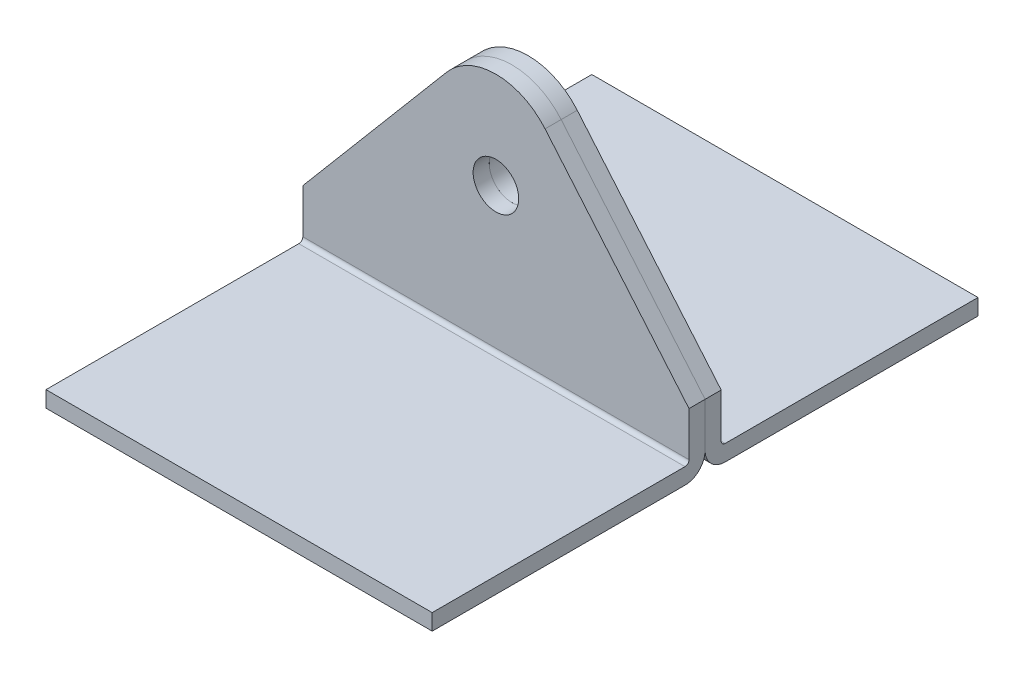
ISO-10303-21;
HEADER;
FILE_DESCRIPTION(('STEP AP214'),'2;1');
FILE_NAME('part.step','',(''),(''),'','','');
FILE_SCHEMA(('AUTOMOTIVE_DESIGN { 1 0 10303 214 1 1 1 1 }'));
ENDSEC;
DATA;
#1=APPLICATION_CONTEXT('core data for automotive mechanical design processes');
#2=APPLICATION_PROTOCOL_DEFINITION('international standard','automotive_design',2000,#1);
#3=PRODUCT_CONTEXT('',#1,'mechanical');
#4=PRODUCT('Part','Part','',(#3));
#5=PRODUCT_RELATED_PRODUCT_CATEGORY('part','',(#4));
#6=PRODUCT_DEFINITION_FORMATION('','',#4);
#7=PRODUCT_DEFINITION_CONTEXT('part definition',#1,'design');
#8=PRODUCT_DEFINITION('design','',#6,#7);
#9=PRODUCT_DEFINITION_SHAPE('','',#8);
#10=(LENGTH_UNIT() NAMED_UNIT(*) SI_UNIT(.MILLI.,.METRE.));
#11=(NAMED_UNIT(*) PLANE_ANGLE_UNIT() SI_UNIT($,.RADIAN.));
#12=(NAMED_UNIT(*) SI_UNIT($,.STERADIAN.) SOLID_ANGLE_UNIT());
#13=UNCERTAINTY_MEASURE_WITH_UNIT(LENGTH_MEASURE(1.E-05),#10,'distance_accuracy_value','');
#14=(GEOMETRIC_REPRESENTATION_CONTEXT(3) GLOBAL_UNCERTAINTY_ASSIGNED_CONTEXT((#13)) GLOBAL_UNIT_ASSIGNED_CONTEXT((#10,
#11,#12)) REPRESENTATION_CONTEXT('',''));
#15=CARTESIAN_POINT('',(0.,0.,0.));
#16=DIRECTION('',(0.,0.,1.));
#17=DIRECTION('',(1.,0.,0.));
#18=AXIS2_PLACEMENT_3D('',#15,#16,#17);
#19=CARTESIAN_POINT('',(-19.05,1.984375,0.));
#20=DIRECTION('',(0.,0.,-1.));
#21=DIRECTION('',(-1.,0.,0.));
#22=AXIS2_PLACEMENT_3D('',#19,#20,#21);
#23=PLANE('',#22);
#24=CARTESIAN_POINT('',(0.,15.875,0.));
#25=DIRECTION('',(0.,0.,1.));
#26=DIRECTION('',(1.,0.,0.));
#27=AXIS2_PLACEMENT_3D('',#24,#25,#26);
#28=CIRCLE('',#27,2.24789999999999);
#29=CARTESIAN_POINT('',(2.24789999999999,15.875,0.));
#30=VERTEX_POINT('',#29);
#31=EDGE_CURVE('P0_E196',#30,#30,#28,.T.);
#32=ORIENTED_EDGE('',*,*,#31,.F.);
#33=EDGE_LOOP('',(#32));
#34=FACE_BOUND('',#33,.T.);
#35=DIRECTION('',(0.,1.,0.));
#36=VECTOR('',#35,1.);
#37=CARTESIAN_POINT('',(19.05,1.984375,0.));
#38=LINE('',#37,#36);
#39=CARTESIAN_POINT('',(19.05,1.984375,0.));
#40=VERTEX_POINT('',#39);
#41=CARTESIAN_POINT('',(19.05,6.34999999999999,0.));
#42=VERTEX_POINT('',#41);
#43=EDGE_CURVE('P0_E117',#40,#42,#38,.T.);
#44=ORIENTED_EDGE('',*,*,#43,.T.);
#45=DIRECTION('',(-0.645561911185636,0.763707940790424,0.));
#46=VECTOR('',#45,1.);
#47=CARTESIAN_POINT('',(5.32416184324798,22.5878408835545,0.));
#48=LINE('',#47,#46);
#49=CARTESIAN_POINT('',(4.84954542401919,23.1493181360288,0.));
#50=VERTEX_POINT('',#49);
#51=EDGE_CURVE('P0_E31',#42,#50,#48,.T.);
#52=ORIENTED_EDGE('',*,*,#51,.T.);
#53=CARTESIAN_POINT('',(0.,19.05,0.));
#54=DIRECTION('',(0.,0.,-1.));
#55=DIRECTION('',(-1.,0.,0.));
#56=AXIS2_PLACEMENT_3D('',#53,#54,#55);
#57=CIRCLE('',#56,6.35);
#58=CARTESIAN_POINT('',(-4.84954542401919,23.1493181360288,0.));
#59=VERTEX_POINT('',#58);
#60=EDGE_CURVE('P0_E121',#50,#59,#57,.F.);
#61=ORIENTED_EDGE('',*,*,#60,.T.);
#62=DIRECTION('',(-0.645561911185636,-0.763707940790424,0.));
#63=VECTOR('',#62,1.);
#64=CARTESIAN_POINT('',(-21.2023437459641,3.80375000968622,0.));
#65=LINE('',#64,#63);
#66=CARTESIAN_POINT('',(-19.05,6.35,0.));
#67=VERTEX_POINT('',#66);
#68=EDGE_CURVE('P0_E152',#59,#67,#65,.T.);
#69=ORIENTED_EDGE('',*,*,#68,.T.);
#70=DIRECTION('',(0.,1.,0.));
#71=VECTOR('',#70,1.);
#72=CARTESIAN_POINT('',(-19.05,1.984375,0.));
#73=LINE('',#72,#71);
#74=CARTESIAN_POINT('',(-19.05,1.984375,0.));
#75=VERTEX_POINT('',#74);
#76=EDGE_CURVE('P0_E134',#75,#67,#73,.T.);
#77=ORIENTED_EDGE('',*,*,#76,.F.);
#78=DIRECTION('',(1.,0.,0.));
#79=VECTOR('',#78,1.);
#80=CARTESIAN_POINT('',(-19.05,1.984375,0.));
#81=LINE('',#80,#79);
#82=EDGE_CURVE('P0_E116',#75,#40,#81,.T.);
#83=ORIENTED_EDGE('',*,*,#82,.T.);
#84=EDGE_LOOP('',(#44,#52,#61,#69,#77,#83));
#85=FACE_BOUND('',#84,.T.);
#86=ADVANCED_FACE('P0_F16',(#34,#85),#23,.F.);
#87=CARTESIAN_POINT('',(-19.05,1.984375,-1.5875));
#88=DIRECTION('',(0.,0.,-1.));
#89=DIRECTION('',(-1.,0.,0.));
#90=AXIS2_PLACEMENT_3D('',#87,#88,#89);
#91=PLANE('',#90);
#92=CARTESIAN_POINT('',(0.,15.875,-1.5875));
#93=DIRECTION('',(0.,0.,-1.));
#94=DIRECTION('',(-1.,0.,0.));
#95=AXIS2_PLACEMENT_3D('',#92,#93,#94);
#96=CIRCLE('',#95,2.24789999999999);
#97=CARTESIAN_POINT('',(2.24789999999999,15.875,-1.5875));
#98=VERTEX_POINT('',#97);
#99=EDGE_CURVE('P0_E19',#98,#98,#96,.T.);
#100=ORIENTED_EDGE('',*,*,#99,.F.);
#101=EDGE_LOOP('',(#100));
#102=FACE_BOUND('',#101,.T.);
#103=DIRECTION('',(-0.645561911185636,0.763707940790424,0.));
#104=VECTOR('',#103,1.);
#105=CARTESIAN_POINT('',(5.32416184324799,22.5878408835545,-1.5875));
#106=LINE('',#105,#104);
#107=CARTESIAN_POINT('',(19.05,6.35,-1.5875));
#108=VERTEX_POINT('',#107);
#109=CARTESIAN_POINT('',(4.84954542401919,23.1493181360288,-1.5875));
#110=VERTEX_POINT('',#109);
#111=EDGE_CURVE('P0_E183',#108,#110,#106,.T.);
#112=ORIENTED_EDGE('',*,*,#111,.F.);
#113=DIRECTION('',(0.,1.,0.));
#114=VECTOR('',#113,1.);
#115=CARTESIAN_POINT('',(19.05,1.984375,-1.5875));
#116=LINE('',#115,#114);
#117=CARTESIAN_POINT('',(19.05,1.984375,-1.5875));
#118=VERTEX_POINT('',#117);
#119=EDGE_CURVE('P0_E120',#118,#108,#116,.T.);
#120=ORIENTED_EDGE('',*,*,#119,.F.);
#121=DIRECTION('',(1.,0.,0.));
#122=VECTOR('',#121,1.);
#123=CARTESIAN_POINT('',(-19.05,1.984375,-1.5875));
#124=LINE('',#123,#122);
#125=CARTESIAN_POINT('',(-19.05,1.984375,-1.5875));
#126=VERTEX_POINT('',#125);
#127=EDGE_CURVE('P0_E75',#126,#118,#124,.T.);
#128=ORIENTED_EDGE('',*,*,#127,.F.);
#129=DIRECTION('',(0.,1.,0.));
#130=VECTOR('',#129,1.);
#131=CARTESIAN_POINT('',(-19.05,1.984375,-1.5875));
#132=LINE('',#131,#130);
#133=CARTESIAN_POINT('',(-19.05,6.35,-1.5875));
#134=VERTEX_POINT('',#133);
#135=EDGE_CURVE('P0_E164',#126,#134,#132,.T.);
#136=ORIENTED_EDGE('',*,*,#135,.T.);
#137=DIRECTION('',(-0.645561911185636,-0.763707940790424,0.));
#138=VECTOR('',#137,1.);
#139=CARTESIAN_POINT('',(-21.2023437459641,3.80375000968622,-1.5875));
#140=LINE('',#139,#138);
#141=CARTESIAN_POINT('',(-4.84954542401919,23.1493181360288,-1.5875));
#142=VERTEX_POINT('',#141);
#143=EDGE_CURVE('P0_E156',#142,#134,#140,.T.);
#144=ORIENTED_EDGE('',*,*,#143,.F.);
#145=CARTESIAN_POINT('',(0.,19.05,-1.5875));
#146=DIRECTION('',(0.,0.,-1.));
#147=DIRECTION('',(-1.,0.,0.));
#148=AXIS2_PLACEMENT_3D('',#145,#146,#147);
#149=CIRCLE('',#148,6.35);
#150=EDGE_CURVE('P0_E11',#110,#142,#149,.F.);
#151=ORIENTED_EDGE('',*,*,#150,.F.);
#152=EDGE_LOOP('',(#112,#120,#128,#136,#144,#151));
#153=FACE_BOUND('',#152,.T.);
#154=ADVANCED_FACE('P0_F187',(#102,#153),#91,.T.);
#155=CARTESIAN_POINT('',(-19.05,1.984375,-1.984375));
#156=DIRECTION('',(1.,0.,0.));
#157=DIRECTION('',(0.,0.,-1.));
#158=AXIS2_PLACEMENT_3D('',#155,#156,#157);
#159=CYLINDRICAL_SURFACE('',#158,0.396875);
#160=CARTESIAN_POINT('',(19.05,1.984375,-1.984375));
#161=DIRECTION('',(-1.,0.,0.));
#162=DIRECTION('',(0.,0.,1.));
#163=AXIS2_PLACEMENT_3D('',#160,#161,#162);
#164=CIRCLE('',#163,0.396875);
#165=CARTESIAN_POINT('',(19.05,1.5875,-1.984375));
#166=VERTEX_POINT('',#165);
#167=EDGE_CURVE('P0_E124',#166,#118,#164,.T.);
#168=ORIENTED_EDGE('',*,*,#167,.F.);
#169=DIRECTION('',(1.,0.,0.));
#170=VECTOR('',#169,1.);
#171=CARTESIAN_POINT('',(-19.05,1.5875,-1.984375));
#172=LINE('',#171,#170);
#173=CARTESIAN_POINT('',(-19.05,1.5875,-1.984375));
#174=VERTEX_POINT('',#173);
#175=EDGE_CURVE('P0_E138',#174,#166,#172,.T.);
#176=ORIENTED_EDGE('',*,*,#175,.F.);
#177=CARTESIAN_POINT('',(-19.05,1.984375,-1.984375));
#178=DIRECTION('',(-1.,0.,0.));
#179=DIRECTION('',(0.,0.,1.));
#180=AXIS2_PLACEMENT_3D('',#177,#178,#179);
#181=CIRCLE('',#180,0.396875);
#182=EDGE_CURVE('P0_E111',#174,#126,#181,.T.);
#183=ORIENTED_EDGE('',*,*,#182,.T.);
#184=ORIENTED_EDGE('',*,*,#127,.T.);
#185=EDGE_LOOP('',(#168,#176,#183,#184));
#186=FACE_BOUND('',#185,.T.);
#187=ADVANCED_FACE('P0_F171',(#186),#159,.F.);
#188=CARTESIAN_POINT('',(-19.05,1.5875,-1.984375));
#189=DIRECTION('',(0.,1.,0.));
#190=DIRECTION('',(0.,0.,-1.));
#191=AXIS2_PLACEMENT_3D('',#188,#189,#190);
#192=PLANE('',#191);
#193=DIRECTION('',(0.,0.,1.));
#194=VECTOR('',#193,1.);
#195=CARTESIAN_POINT('',(19.05,1.5875,-1.984375));
#196=LINE('',#195,#194);
#197=CARTESIAN_POINT('',(19.05,1.5875,-26.924));
#198=VERTEX_POINT('',#197);
#199=EDGE_CURVE('P0_E127',#198,#166,#196,.T.);
#200=ORIENTED_EDGE('',*,*,#199,.F.);
#201=DIRECTION('',(1.,0.,0.));
#202=VECTOR('',#201,1.);
#203=CARTESIAN_POINT('',(-19.05,1.5875,-26.924));
#204=LINE('',#203,#202);
#205=CARTESIAN_POINT('',(-19.05,1.5875,-26.924));
#206=VERTEX_POINT('',#205);
#207=EDGE_CURVE('P0_E97',#206,#198,#204,.T.);
#208=ORIENTED_EDGE('',*,*,#207,.F.);
#209=DIRECTION('',(0.,0.,1.));
#210=VECTOR('',#209,1.);
#211=CARTESIAN_POINT('',(-19.05,1.5875,-1.984375));
#212=LINE('',#211,#210);
#213=EDGE_CURVE('P0_E109',#206,#174,#212,.T.);
#214=ORIENTED_EDGE('',*,*,#213,.T.);
#215=ORIENTED_EDGE('',*,*,#175,.T.);
#216=EDGE_LOOP('',(#200,#208,#214,#215));
#217=FACE_BOUND('',#216,.T.);
#218=ADVANCED_FACE('P0_F174',(#217),#192,.T.);
#219=CARTESIAN_POINT('',(-19.05,0.,-26.924));
#220=DIRECTION('',(0.,0.,-1.));
#221=DIRECTION('',(-1.,0.,0.));
#222=AXIS2_PLACEMENT_3D('',#219,#220,#221);
#223=PLANE('',#222);
#224=DIRECTION('',(0.,1.,0.));
#225=VECTOR('',#224,1.);
#226=CARTESIAN_POINT('',(19.05,0.,-26.924));
#227=LINE('',#226,#225);
#228=CARTESIAN_POINT('',(19.05,0.,-26.924));
#229=VERTEX_POINT('',#228);
#230=EDGE_CURVE('P0_E94',#229,#198,#227,.T.);
#231=ORIENTED_EDGE('',*,*,#230,.F.);
#232=DIRECTION('',(1.,0.,0.));
#233=VECTOR('',#232,1.);
#234=CARTESIAN_POINT('',(-19.05,0.,-26.924));
#235=LINE('',#234,#233);
#236=CARTESIAN_POINT('',(-19.05,0.,-26.924));
#237=VERTEX_POINT('',#236);
#238=EDGE_CURVE('P0_E88',#237,#229,#235,.T.);
#239=ORIENTED_EDGE('',*,*,#238,.F.);
#240=DIRECTION('',(0.,1.,0.));
#241=VECTOR('',#240,1.);
#242=CARTESIAN_POINT('',(-19.05,0.,-26.924));
#243=LINE('',#242,#241);
#244=EDGE_CURVE('P0_E92',#237,#206,#243,.T.);
#245=ORIENTED_EDGE('',*,*,#244,.T.);
#246=ORIENTED_EDGE('',*,*,#207,.T.);
#247=EDGE_LOOP('',(#231,#239,#245,#246));
#248=FACE_BOUND('',#247,.T.);
#249=ADVANCED_FACE('P0_F90',(#248),#223,.T.);
#250=CARTESIAN_POINT('',(-19.05,0.,-1.984375));
#251=DIRECTION('',(0.,1.,0.));
#252=DIRECTION('',(0.,0.,-1.));
#253=AXIS2_PLACEMENT_3D('',#250,#251,#252);
#254=PLANE('',#253);
#255=DIRECTION('',(0.,0.,1.));
#256=VECTOR('',#255,1.);
#257=CARTESIAN_POINT('',(19.05,0.,-1.984375));
#258=LINE('',#257,#256);
#259=CARTESIAN_POINT('',(19.05,0.,-1.984375));
#260=VERTEX_POINT('',#259);
#261=EDGE_CURVE('P0_E131',#229,#260,#258,.T.);
#262=ORIENTED_EDGE('',*,*,#261,.T.);
#263=DIRECTION('',(1.,0.,0.));
#264=VECTOR('',#263,1.);
#265=CARTESIAN_POINT('',(-19.05,0.,-1.984375));
#266=LINE('',#265,#264);
#267=CARTESIAN_POINT('',(-19.05,0.,-1.984375));
#268=VERTEX_POINT('',#267);
#269=EDGE_CURVE('P0_E98',#268,#260,#266,.T.);
#270=ORIENTED_EDGE('',*,*,#269,.F.);
#271=DIRECTION('',(0.,0.,1.));
#272=VECTOR('',#271,1.);
#273=CARTESIAN_POINT('',(-19.05,0.,-1.984375));
#274=LINE('',#273,#272);
#275=EDGE_CURVE('P0_E101',#237,#268,#274,.T.);
#276=ORIENTED_EDGE('',*,*,#275,.F.);
#277=ORIENTED_EDGE('',*,*,#238,.T.);
#278=EDGE_LOOP('',(#262,#270,#276,#277));
#279=FACE_BOUND('',#278,.T.);
#280=ADVANCED_FACE('P0_F102',(#279),#254,.F.);
#281=CARTESIAN_POINT('',(-19.05,1.984375,-1.984375));
#282=DIRECTION('',(1.,0.,0.));
#283=DIRECTION('',(0.,0.,-1.));
#284=AXIS2_PLACEMENT_3D('',#281,#282,#283);
#285=CYLINDRICAL_SURFACE('',#284,1.984375);
#286=CARTESIAN_POINT('',(19.05,1.984375,-1.984375));
#287=DIRECTION('',(-1.,0.,0.));
#288=DIRECTION('',(0.,0.,1.));
#289=AXIS2_PLACEMENT_3D('',#286,#287,#288);
#290=CIRCLE('',#289,1.984375);
#291=EDGE_CURVE('P0_E67',#260,#40,#290,.T.);
#292=ORIENTED_EDGE('',*,*,#291,.T.);
#293=ORIENTED_EDGE('',*,*,#82,.F.);
#294=CARTESIAN_POINT('',(-19.05,1.984375,-1.984375));
#295=DIRECTION('',(-1.,0.,0.));
#296=DIRECTION('',(0.,0.,1.));
#297=AXIS2_PLACEMENT_3D('',#294,#295,#296);
#298=CIRCLE('',#297,1.984375);
#299=EDGE_CURVE('P0_E40',#268,#75,#298,.T.);
#300=ORIENTED_EDGE('',*,*,#299,.F.);
#301=ORIENTED_EDGE('',*,*,#269,.T.);
#302=EDGE_LOOP('',(#292,#293,#300,#301));
#303=FACE_BOUND('',#302,.T.);
#304=ADVANCED_FACE('P0_F178',(#303),#285,.T.);
#305=CARTESIAN_POINT('',(-19.05,1.984375,-1.984375));
#306=DIRECTION('',(-1.,0.,0.));
#307=DIRECTION('',(0.,0.,1.));
#308=AXIS2_PLACEMENT_3D('',#305,#306,#307);
#309=PLANE('',#308);
#310=DIRECTION('',(0.,0.,1.));
#311=VECTOR('',#310,1.);
#312=CARTESIAN_POINT('',(-19.05,6.35,-1.984375));
#313=LINE('',#312,#311);
#314=EDGE_CURVE('P0_E24',#134,#67,#313,.T.);
#315=ORIENTED_EDGE('',*,*,#314,.F.);
#316=ORIENTED_EDGE('',*,*,#135,.F.);
#317=ORIENTED_EDGE('',*,*,#182,.F.);
#318=ORIENTED_EDGE('',*,*,#213,.F.);
#319=ORIENTED_EDGE('',*,*,#244,.F.);
#320=ORIENTED_EDGE('',*,*,#275,.T.);
#321=ORIENTED_EDGE('',*,*,#299,.T.);
#322=ORIENTED_EDGE('',*,*,#76,.T.);
#323=EDGE_LOOP('',(#315,#316,#317,#318,#319,#320,#321,#322));
#324=FACE_BOUND('',#323,.T.);
#325=ADVANCED_FACE('P0_F106',(#324),#309,.T.);
#326=CARTESIAN_POINT('',(19.05,1.984375,-1.984375));
#327=DIRECTION('',(-1.,0.,0.));
#328=DIRECTION('',(0.,0.,1.));
#329=AXIS2_PLACEMENT_3D('',#326,#327,#328);
#330=PLANE('',#329);
#331=ORIENTED_EDGE('',*,*,#119,.T.);
#332=DIRECTION('',(0.,0.,1.));
#333=VECTOR('',#332,1.);
#334=CARTESIAN_POINT('',(19.05,6.35,-1.984375));
#335=LINE('',#334,#333);
#336=EDGE_CURVE('P0_E141',#108,#42,#335,.T.);
#337=ORIENTED_EDGE('',*,*,#336,.T.);
#338=ORIENTED_EDGE('',*,*,#43,.F.);
#339=ORIENTED_EDGE('',*,*,#291,.F.);
#340=ORIENTED_EDGE('',*,*,#261,.F.);
#341=ORIENTED_EDGE('',*,*,#230,.T.);
#342=ORIENTED_EDGE('',*,*,#199,.T.);
#343=ORIENTED_EDGE('',*,*,#167,.T.);
#344=EDGE_LOOP('',(#331,#337,#338,#339,#340,#341,#342,#343));
#345=FACE_BOUND('',#344,.T.);
#346=ADVANCED_FACE('P0_F176',(#345),#330,.F.);
#347=CARTESIAN_POINT('',(0.,19.05,66.3992631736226));
#348=DIRECTION('',(0.,0.,-1.));
#349=DIRECTION('',(-1.,0.,0.));
#350=AXIS2_PLACEMENT_3D('',#347,#348,#349);
#351=CYLINDRICAL_SURFACE('',#350,6.35);
#352=ORIENTED_EDGE('',*,*,#60,.F.);
#353=DIRECTION('',(0.,0.,-1.));
#354=VECTOR('',#353,1.);
#355=CARTESIAN_POINT('',(4.84954542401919,23.1493181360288,66.3992631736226));
#356=LINE('',#355,#354);
#357=EDGE_CURVE('P0_E188',#50,#110,#356,.T.);
#358=ORIENTED_EDGE('',*,*,#357,.T.);
#359=ORIENTED_EDGE('',*,*,#150,.T.);
#360=DIRECTION('',(0.,0.,-1.));
#361=VECTOR('',#360,1.);
#362=CARTESIAN_POINT('',(-4.84954542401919,23.1493181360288,66.3992631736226));
#363=LINE('',#362,#361);
#364=EDGE_CURVE('P0_E191',#59,#142,#363,.T.);
#365=ORIENTED_EDGE('',*,*,#364,.F.);
#366=EDGE_LOOP('',(#352,#358,#359,#365));
#367=FACE_BOUND('',#366,.T.);
#368=ADVANCED_FACE('P0_F224',(#367),#351,.T.);
#369=CARTESIAN_POINT('',(-4.8495454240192,23.1493181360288,66.3992631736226));
#370=DIRECTION('',(0.763707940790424,-0.645561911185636,0.));
#371=DIRECTION('',(-0.645561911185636,-0.763707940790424,0.));
#372=AXIS2_PLACEMENT_3D('',#369,#370,#371);
#373=PLANE('',#372);
#374=ORIENTED_EDGE('',*,*,#68,.F.);
#375=ORIENTED_EDGE('',*,*,#364,.T.);
#376=ORIENTED_EDGE('',*,*,#143,.T.);
#377=ORIENTED_EDGE('',*,*,#314,.T.);
#378=EDGE_LOOP('',(#374,#375,#376,#377));
#379=FACE_BOUND('',#378,.T.);
#380=ADVANCED_FACE('P0_F149',(#379),#373,.F.);
#381=CARTESIAN_POINT('',(19.05,6.34999999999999,66.3992631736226));
#382=DIRECTION('',(-0.763707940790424,-0.645561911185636,0.));
#383=DIRECTION('',(-0.645561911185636,0.763707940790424,0.));
#384=AXIS2_PLACEMENT_3D('',#381,#382,#383);
#385=PLANE('',#384);
#386=ORIENTED_EDGE('',*,*,#51,.F.);
#387=ORIENTED_EDGE('',*,*,#336,.F.);
#388=ORIENTED_EDGE('',*,*,#111,.T.);
#389=ORIENTED_EDGE('',*,*,#357,.F.);
#390=EDGE_LOOP('',(#386,#387,#388,#389));
#391=FACE_BOUND('',#390,.T.);
#392=ADVANCED_FACE('P0_F181',(#391),#385,.F.);
#393=CARTESIAN_POINT('',(0.,15.875,0.));
#394=DIRECTION('',(0.,0.,1.));
#395=DIRECTION('',(1.,0.,0.));
#396=AXIS2_PLACEMENT_3D('',#393,#394,#395);
#397=CYLINDRICAL_SURFACE('',#396,2.24789999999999);
#398=CARTESIAN_POINT('',(2.24789999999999,15.875,-1.5875));
#399=CARTESIAN_POINT('',(2.24789999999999,15.875,-1.57096354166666));
#400=CARTESIAN_POINT('',(2.24789999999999,15.875,-1.55442708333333));
#401=CARTESIAN_POINT('',(2.24789999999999,15.875,-1.52135416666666));
#402=CARTESIAN_POINT('',(2.24789999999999,15.875,-1.50481770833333));
#403=CARTESIAN_POINT('',(2.24789999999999,15.875,-1.47174479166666));
#404=CARTESIAN_POINT('',(2.24789999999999,15.875,-1.45520833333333));
#405=CARTESIAN_POINT('',(2.24789999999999,15.875,-1.42213541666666));
#406=CARTESIAN_POINT('',(2.24789999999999,15.875,-1.40559895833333));
#407=CARTESIAN_POINT('',(2.24789999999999,15.875,-1.37252604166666));
#408=CARTESIAN_POINT('',(2.24789999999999,15.875,-1.35598958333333));
#409=CARTESIAN_POINT('',(2.24789999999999,15.875,-1.32291666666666));
#410=CARTESIAN_POINT('',(2.24789999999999,15.875,-1.30638020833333));
#411=CARTESIAN_POINT('',(2.24789999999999,15.875,-1.27330729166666));
#412=CARTESIAN_POINT('',(2.24789999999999,15.875,-1.25677083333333));
#413=CARTESIAN_POINT('',(2.24789999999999,15.875,-1.22369791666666));
#414=CARTESIAN_POINT('',(2.24789999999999,15.875,-1.20716145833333));
#415=CARTESIAN_POINT('',(2.24789999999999,15.875,-1.17408854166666));
#416=CARTESIAN_POINT('',(2.24789999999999,15.875,-1.15755208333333));
#417=CARTESIAN_POINT('',(2.24789999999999,15.875,-1.12447916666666));
#418=CARTESIAN_POINT('',(2.24789999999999,15.875,-1.10794270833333));
#419=CARTESIAN_POINT('',(2.24789999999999,15.875,-1.07486979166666));
#420=CARTESIAN_POINT('',(2.24789999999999,15.875,-1.05833333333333));
#421=CARTESIAN_POINT('',(2.24789999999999,15.875,-1.02526041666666));
#422=CARTESIAN_POINT('',(2.24789999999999,15.875,-1.00872395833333));
#423=CARTESIAN_POINT('',(2.24789999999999,15.875,-0.975651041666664));
#424=CARTESIAN_POINT('',(2.24789999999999,15.875,-0.959114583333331));
#425=CARTESIAN_POINT('',(2.24789999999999,15.875,-0.926041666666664));
#426=CARTESIAN_POINT('',(2.24789999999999,15.875,-0.909505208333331));
#427=CARTESIAN_POINT('',(2.24789999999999,15.875,-0.876432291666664));
#428=CARTESIAN_POINT('',(2.24789999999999,15.875,-0.859895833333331));
#429=CARTESIAN_POINT('',(2.24789999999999,15.875,-0.826822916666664));
#430=CARTESIAN_POINT('',(2.24789999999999,15.875,-0.810286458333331));
#431=CARTESIAN_POINT('',(2.24789999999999,15.875,-0.777213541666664));
#432=CARTESIAN_POINT('',(2.24789999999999,15.875,-0.760677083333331));
#433=CARTESIAN_POINT('',(2.24789999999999,15.875,-0.727604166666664));
#434=CARTESIAN_POINT('',(2.24789999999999,15.875,-0.711067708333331));
#435=CARTESIAN_POINT('',(2.24789999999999,15.875,-0.677994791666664));
#436=CARTESIAN_POINT('',(2.24789999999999,15.875,-0.661458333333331));
#437=CARTESIAN_POINT('',(2.24789999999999,15.875,-0.628385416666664));
#438=CARTESIAN_POINT('',(2.24789999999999,15.875,-0.611848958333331));
#439=CARTESIAN_POINT('',(2.24789999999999,15.875,-0.578776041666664));
#440=CARTESIAN_POINT('',(2.24789999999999,15.875,-0.56223958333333));
#441=CARTESIAN_POINT('',(2.24789999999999,15.875,-0.529166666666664));
#442=CARTESIAN_POINT('',(2.24789999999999,15.875,-0.51263020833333));
#443=CARTESIAN_POINT('',(2.24789999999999,15.875,-0.479557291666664));
#444=CARTESIAN_POINT('',(2.24789999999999,15.875,-0.46302083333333));
#445=CARTESIAN_POINT('',(2.24789999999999,15.875,-0.429947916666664));
#446=CARTESIAN_POINT('',(2.24789999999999,15.875,-0.41341145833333));
#447=CARTESIAN_POINT('',(2.24789999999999,15.875,-0.380338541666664));
#448=CARTESIAN_POINT('',(2.24789999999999,15.875,-0.36380208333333));
#449=CARTESIAN_POINT('',(2.24789999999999,15.875,-0.330729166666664));
#450=CARTESIAN_POINT('',(2.24789999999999,15.875,-0.31419270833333));
#451=CARTESIAN_POINT('',(2.24789999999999,15.875,-0.281119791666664));
#452=CARTESIAN_POINT('',(2.24789999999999,15.875,-0.26458333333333));
#453=CARTESIAN_POINT('',(2.24789999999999,15.875,-0.231510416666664));
#454=CARTESIAN_POINT('',(2.24789999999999,15.875,-0.21497395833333));
#455=CARTESIAN_POINT('',(2.24789999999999,15.875,-0.181901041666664));
#456=CARTESIAN_POINT('',(2.24789999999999,15.875,-0.16536458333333));
#457=CARTESIAN_POINT('',(2.24789999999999,15.875,-0.132291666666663));
#458=CARTESIAN_POINT('',(2.24789999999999,15.875,-0.11575520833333));
#459=CARTESIAN_POINT('',(2.24789999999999,15.875,-0.0826822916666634));
#460=CARTESIAN_POINT('',(2.24789999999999,15.875,-0.0661458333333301));
#461=CARTESIAN_POINT('',(2.24789999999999,15.875,-0.0330729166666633));
#462=CARTESIAN_POINT('',(2.24789999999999,15.875,-0.01653645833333));
#463=CARTESIAN_POINT('',(2.24789999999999,15.875,0.));
#464=B_SPLINE_CURVE_WITH_KNOTS('',3,(#398,#399,#400,#401,#402,#403,#404,#405,#406,#407,#408,
#409,#410,#411,#412,#413,#414,#415,#416,#417,#418,#419,#420,#421,#422,#423,#424,#425,#426,#427,
#428,#429,#430,#431,#432,#433,#434,#435,#436,#437,#438,#439,#440,#441,#442,#443,#444,#445,#446,
#447,#448,#449,#450,#451,#452,#453,#454,#455,#456,#457,#458,#459,#460,#461,#462,#463),
.UNSPECIFIED.,.F.,.F.,(4,2,2,2,2,2,2,2,2,2,2,2,2,2,2,2,2,2,2,2,2,2,2,2,2,2,2,2,2,2,2,2,4),(0.,
0.049609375,0.0992187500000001,0.148828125,0.1984375,0.248046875,0.29765625,0.347265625,
0.396875,0.446484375,0.49609375,0.545703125,0.5953125,0.644921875,0.69453125,0.744140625,
0.793750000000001,0.843359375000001,0.892968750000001,0.942578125,0.9921875,1.041796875,
1.09140625,1.141015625,1.190625,1.240234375,1.28984375,1.339453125,1.3890625,1.438671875,
1.48828125,1.537890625,1.5875),.UNSPECIFIED.);
#465=EDGE_CURVE('P0_BSEAM203',#98,#30,#464,.T.);
#466=ORIENTED_EDGE('',*,*,#99,.T.);
#467=ORIENTED_EDGE('',*,*,#31,.T.);
#468=ORIENTED_EDGE('',*,*,#465,.T.);
#469=ORIENTED_EDGE('',*,*,#465,.F.);
#470=EDGE_LOOP('',(#466,#468,#467,#469));
#471=FACE_BOUND('',#470,.T.);
#472=ADVANCED_FACE('P0_F203',(#471),#397,.F.);
#473=CLOSED_SHELL('',(#86,#154,#187,#218,#249,#280,#304,#325,#346,#368,#380,#392,#472));
#474=MANIFOLD_SOLID_BREP('P0_B1',#473);
#475=CARTESIAN_POINT('',(19.05,1.984375,0.));
#476=DIRECTION('',(0.,0.,1.));
#477=DIRECTION('',(1.,0.,0.));
#478=AXIS2_PLACEMENT_3D('',#475,#476,#477);
#479=PLANE('',#478);
#480=CARTESIAN_POINT('',(0.,15.875,0.));
#481=DIRECTION('',(0.,0.,-1.));
#482=DIRECTION('',(-1.,0.,0.));
#483=AXIS2_PLACEMENT_3D('',#480,#481,#482);
#484=CIRCLE('',#483,2.24789999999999);
#485=CARTESIAN_POINT('',(-2.24789999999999,15.875,0.));
#486=VERTEX_POINT('',#485);
#487=EDGE_CURVE('P1_E195',#486,#486,#484,.T.);
#488=ORIENTED_EDGE('',*,*,#487,.F.);
#489=EDGE_LOOP('',(#488));
#490=FACE_BOUND('',#489,.T.);
#491=DIRECTION('',(0.,1.,0.));
#492=VECTOR('',#491,1.);
#493=CARTESIAN_POINT('',(-19.05,1.984375,0.));
#494=LINE('',#493,#492);
#495=CARTESIAN_POINT('',(-19.05,1.984375,0.));
#496=VERTEX_POINT('',#495);
#497=CARTESIAN_POINT('',(-19.05,6.35,0.));
#498=VERTEX_POINT('',#497);
#499=EDGE_CURVE('P1_E116',#496,#498,#494,.T.);
#500=ORIENTED_EDGE('',*,*,#499,.T.);
#501=DIRECTION('',(0.645561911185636,0.763707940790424,0.));
#502=VECTOR('',#501,1.);
#503=CARTESIAN_POINT('',(-5.32416184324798,22.5878408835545,0.));
#504=LINE('',#503,#502);
#505=CARTESIAN_POINT('',(-4.84954542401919,23.1493181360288,0.));
#506=VERTEX_POINT('',#505);
#507=EDGE_CURVE('P1_E30',#498,#506,#504,.T.);
#508=ORIENTED_EDGE('',*,*,#507,.T.);
#509=CARTESIAN_POINT('',(0.,19.05,0.));
#510=DIRECTION('',(0.,0.,1.));
#511=DIRECTION('',(1.,0.,0.));
#512=AXIS2_PLACEMENT_3D('',#509,#510,#511);
#513=CIRCLE('',#512,6.35);
#514=CARTESIAN_POINT('',(4.84954542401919,23.1493181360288,0.));
#515=VERTEX_POINT('',#514);
#516=EDGE_CURVE('P1_E120',#506,#515,#513,.F.);
#517=ORIENTED_EDGE('',*,*,#516,.T.);
#518=DIRECTION('',(0.645561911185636,-0.763707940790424,0.));
#519=VECTOR('',#518,1.);
#520=CARTESIAN_POINT('',(21.2023437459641,3.80375000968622,0.));
#521=LINE('',#520,#519);
#522=CARTESIAN_POINT('',(19.05,6.35,0.));
#523=VERTEX_POINT('',#522);
#524=EDGE_CURVE('P1_E151',#515,#523,#521,.T.);
#525=ORIENTED_EDGE('',*,*,#524,.T.);
#526=DIRECTION('',(0.,1.,0.));
#527=VECTOR('',#526,1.);
#528=CARTESIAN_POINT('',(19.05,1.984375,0.));
#529=LINE('',#528,#527);
#530=CARTESIAN_POINT('',(19.05,1.984375,0.));
#531=VERTEX_POINT('',#530);
#532=EDGE_CURVE('P1_E133',#531,#523,#529,.T.);
#533=ORIENTED_EDGE('',*,*,#532,.F.);
#534=DIRECTION('',(-1.,0.,0.));
#535=VECTOR('',#534,1.);
#536=CARTESIAN_POINT('',(19.05,1.984375,0.));
#537=LINE('',#536,#535);
#538=EDGE_CURVE('P1_E115',#531,#496,#537,.T.);
#539=ORIENTED_EDGE('',*,*,#538,.T.);
#540=EDGE_LOOP('',(#500,#508,#517,#525,#533,#539));
#541=FACE_BOUND('',#540,.T.);
#542=ADVANCED_FACE('P1_F15',(#490,#541),#479,.F.);
#543=CARTESIAN_POINT('',(19.05,1.984375,1.5875));
#544=DIRECTION('',(0.,0.,1.));
#545=DIRECTION('',(1.,0.,0.));
#546=AXIS2_PLACEMENT_3D('',#543,#544,#545);
#547=PLANE('',#546);
#548=CARTESIAN_POINT('',(0.,15.875,1.5875));
#549=DIRECTION('',(0.,0.,1.));
#550=DIRECTION('',(1.,0.,0.));
#551=AXIS2_PLACEMENT_3D('',#548,#549,#550);
#552=CIRCLE('',#551,2.24789999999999);
#553=CARTESIAN_POINT('',(2.24789999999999,15.875,1.5875));
#554=VERTEX_POINT('',#553);
#555=EDGE_CURVE('P1_E18',#554,#554,#552,.T.);
#556=ORIENTED_EDGE('',*,*,#555,.F.);
#557=EDGE_LOOP('',(#556));
#558=FACE_BOUND('',#557,.T.);
#559=DIRECTION('',(0.645561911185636,0.763707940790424,0.));
#560=VECTOR('',#559,1.);
#561=CARTESIAN_POINT('',(-5.32416184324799,22.5878408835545,1.5875));
#562=LINE('',#561,#560);
#563=CARTESIAN_POINT('',(-19.05,6.35,1.58750000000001));
#564=VERTEX_POINT('',#563);
#565=CARTESIAN_POINT('',(-4.84954542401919,23.1493181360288,1.58750000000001));
#566=VERTEX_POINT('',#565);
#567=EDGE_CURVE('P1_E182',#564,#566,#562,.T.);
#568=ORIENTED_EDGE('',*,*,#567,.F.);
#569=DIRECTION('',(0.,1.,0.));
#570=VECTOR('',#569,1.);
#571=CARTESIAN_POINT('',(-19.05,1.984375,1.5875));
#572=LINE('',#571,#570);
#573=CARTESIAN_POINT('',(-19.05,1.984375,1.5875));
#574=VERTEX_POINT('',#573);
#575=EDGE_CURVE('P1_E119',#574,#564,#572,.T.);
#576=ORIENTED_EDGE('',*,*,#575,.F.);
#577=DIRECTION('',(-1.,0.,0.));
#578=VECTOR('',#577,1.);
#579=CARTESIAN_POINT('',(19.05,1.984375,1.5875));
#580=LINE('',#579,#578);
#581=CARTESIAN_POINT('',(19.05,1.984375,1.5875));
#582=VERTEX_POINT('',#581);
#583=EDGE_CURVE('P1_E74',#582,#574,#580,.T.);
#584=ORIENTED_EDGE('',*,*,#583,.F.);
#585=DIRECTION('',(0.,1.,0.));
#586=VECTOR('',#585,1.);
#587=CARTESIAN_POINT('',(19.05,1.984375,1.5875));
#588=LINE('',#587,#586);
#589=CARTESIAN_POINT('',(19.05,6.35,1.58750000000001));
#590=VERTEX_POINT('',#589);
#591=EDGE_CURVE('P1_E163',#582,#590,#588,.T.);
#592=ORIENTED_EDGE('',*,*,#591,.T.);
#593=DIRECTION('',(0.645561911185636,-0.763707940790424,0.));
#594=VECTOR('',#593,1.);
#595=CARTESIAN_POINT('',(21.2023437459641,3.80375000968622,1.5875));
#596=LINE('',#595,#594);
#597=CARTESIAN_POINT('',(4.84954542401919,23.1493181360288,1.58750000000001));
#598=VERTEX_POINT('',#597);
#599=EDGE_CURVE('P1_E155',#598,#590,#596,.T.);
#600=ORIENTED_EDGE('',*,*,#599,.F.);
#601=CARTESIAN_POINT('',(0.,19.05,1.58750000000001));
#602=DIRECTION('',(0.,0.,1.));
#603=DIRECTION('',(1.,0.,0.));
#604=AXIS2_PLACEMENT_3D('',#601,#602,#603);
#605=CIRCLE('',#604,6.35);
#606=EDGE_CURVE('P1_E10',#566,#598,#605,.F.);
#607=ORIENTED_EDGE('',*,*,#606,.F.);
#608=EDGE_LOOP('',(#568,#576,#584,#592,#600,#607));
#609=FACE_BOUND('',#608,.T.);
#610=ADVANCED_FACE('P1_F186',(#558,#609),#547,.T.);
#611=CARTESIAN_POINT('',(19.05,1.984375,1.984375));
#612=DIRECTION('',(-1.,0.,0.));
#613=DIRECTION('',(0.,0.,1.));
#614=AXIS2_PLACEMENT_3D('',#611,#612,#613);
#615=CYLINDRICAL_SURFACE('',#614,0.396875);
#616=CARTESIAN_POINT('',(-19.05,1.984375,1.984375));
#617=DIRECTION('',(1.,0.,0.));
#618=DIRECTION('',(0.,0.,-1.));
#619=AXIS2_PLACEMENT_3D('',#616,#617,#618);
#620=CIRCLE('',#619,0.396875);
#621=CARTESIAN_POINT('',(-19.05,1.5875,1.984375));
#622=VERTEX_POINT('',#621);
#623=EDGE_CURVE('P1_E123',#622,#574,#620,.T.);
#624=ORIENTED_EDGE('',*,*,#623,.F.);
#625=DIRECTION('',(-1.,0.,0.));
#626=VECTOR('',#625,1.);
#627=CARTESIAN_POINT('',(19.05,1.5875,1.984375));
#628=LINE('',#627,#626);
#629=CARTESIAN_POINT('',(19.05,1.5875,1.984375));
#630=VERTEX_POINT('',#629);
#631=EDGE_CURVE('P1_E137',#630,#622,#628,.T.);
#632=ORIENTED_EDGE('',*,*,#631,.F.);
#633=CARTESIAN_POINT('',(19.05,1.984375,1.984375));
#634=DIRECTION('',(1.,0.,0.));
#635=DIRECTION('',(0.,0.,-1.));
#636=AXIS2_PLACEMENT_3D('',#633,#634,#635);
#637=CIRCLE('',#636,0.396875);
#638=EDGE_CURVE('P1_E110',#630,#582,#637,.T.);
#639=ORIENTED_EDGE('',*,*,#638,.T.);
#640=ORIENTED_EDGE('',*,*,#583,.T.);
#641=EDGE_LOOP('',(#624,#632,#639,#640));
#642=FACE_BOUND('',#641,.T.);
#643=ADVANCED_FACE('P1_F170',(#642),#615,.F.);
#644=CARTESIAN_POINT('',(19.05,1.5875,1.984375));
#645=DIRECTION('',(0.,1.,0.));
#646=DIRECTION('',(0.,0.,1.));
#647=AXIS2_PLACEMENT_3D('',#644,#645,#646);
#648=PLANE('',#647);
#649=DIRECTION('',(0.,0.,-1.));
#650=VECTOR('',#649,1.);
#651=CARTESIAN_POINT('',(-19.05,1.5875,1.984375));
#652=LINE('',#651,#650);
#653=CARTESIAN_POINT('',(-19.05,1.5875,26.924));
#654=VERTEX_POINT('',#653);
#655=EDGE_CURVE('P1_E126',#654,#622,#652,.T.);
#656=ORIENTED_EDGE('',*,*,#655,.F.);
#657=DIRECTION('',(-1.,0.,0.));
#658=VECTOR('',#657,1.);
#659=CARTESIAN_POINT('',(19.05,1.5875,26.924));
#660=LINE('',#659,#658);
#661=CARTESIAN_POINT('',(19.05,1.5875,26.924));
#662=VERTEX_POINT('',#661);
#663=EDGE_CURVE('P1_E96',#662,#654,#660,.T.);
#664=ORIENTED_EDGE('',*,*,#663,.F.);
#665=DIRECTION('',(0.,0.,-1.));
#666=VECTOR('',#665,1.);
#667=CARTESIAN_POINT('',(19.05,1.5875,1.984375));
#668=LINE('',#667,#666);
#669=EDGE_CURVE('P1_E108',#662,#630,#668,.T.);
#670=ORIENTED_EDGE('',*,*,#669,.T.);
#671=ORIENTED_EDGE('',*,*,#631,.T.);
#672=EDGE_LOOP('',(#656,#664,#670,#671));
#673=FACE_BOUND('',#672,.T.);
#674=ADVANCED_FACE('P1_F173',(#673),#648,.T.);
#675=CARTESIAN_POINT('',(19.05,0.,26.924));
#676=DIRECTION('',(0.,0.,1.));
#677=DIRECTION('',(1.,0.,0.));
#678=AXIS2_PLACEMENT_3D('',#675,#676,#677);
#679=PLANE('',#678);
#680=DIRECTION('',(0.,1.,0.));
#681=VECTOR('',#680,1.);
#682=CARTESIAN_POINT('',(-19.05,0.,26.924));
#683=LINE('',#682,#681);
#684=CARTESIAN_POINT('',(-19.05,0.,26.924));
#685=VERTEX_POINT('',#684);
#686=EDGE_CURVE('P1_E93',#685,#654,#683,.T.);
#687=ORIENTED_EDGE('',*,*,#686,.F.);
#688=DIRECTION('',(-1.,0.,0.));
#689=VECTOR('',#688,1.);
#690=CARTESIAN_POINT('',(19.05,0.,26.924));
#691=LINE('',#690,#689);
#692=CARTESIAN_POINT('',(19.05,0.,26.924));
#693=VERTEX_POINT('',#692);
#694=EDGE_CURVE('P1_E87',#693,#685,#691,.T.);
#695=ORIENTED_EDGE('',*,*,#694,.F.);
#696=DIRECTION('',(0.,1.,0.));
#697=VECTOR('',#696,1.);
#698=CARTESIAN_POINT('',(19.05,0.,26.924));
#699=LINE('',#698,#697);
#700=EDGE_CURVE('P1_E91',#693,#662,#699,.T.);
#701=ORIENTED_EDGE('',*,*,#700,.T.);
#702=ORIENTED_EDGE('',*,*,#663,.T.);
#703=EDGE_LOOP('',(#687,#695,#701,#702));
#704=FACE_BOUND('',#703,.T.);
#705=ADVANCED_FACE('P1_F89',(#704),#679,.T.);
#706=CARTESIAN_POINT('',(19.05,0.,1.984375));
#707=DIRECTION('',(0.,1.,0.));
#708=DIRECTION('',(0.,0.,1.));
#709=AXIS2_PLACEMENT_3D('',#706,#707,#708);
#710=PLANE('',#709);
#711=DIRECTION('',(0.,0.,-1.));
#712=VECTOR('',#711,1.);
#713=CARTESIAN_POINT('',(-19.05,0.,1.984375));
#714=LINE('',#713,#712);
#715=CARTESIAN_POINT('',(-19.05,0.,1.984375));
#716=VERTEX_POINT('',#715);
#717=EDGE_CURVE('P1_E130',#685,#716,#714,.T.);
#718=ORIENTED_EDGE('',*,*,#717,.T.);
#719=DIRECTION('',(-1.,0.,0.));
#720=VECTOR('',#719,1.);
#721=CARTESIAN_POINT('',(19.05,0.,1.984375));
#722=LINE('',#721,#720);
#723=CARTESIAN_POINT('',(19.05,0.,1.984375));
#724=VERTEX_POINT('',#723);
#725=EDGE_CURVE('P1_E97',#724,#716,#722,.T.);
#726=ORIENTED_EDGE('',*,*,#725,.F.);
#727=DIRECTION('',(0.,0.,-1.));
#728=VECTOR('',#727,1.);
#729=CARTESIAN_POINT('',(19.05,0.,1.984375));
#730=LINE('',#729,#728);
#731=EDGE_CURVE('P1_E100',#693,#724,#730,.T.);
#732=ORIENTED_EDGE('',*,*,#731,.F.);
#733=ORIENTED_EDGE('',*,*,#694,.T.);
#734=EDGE_LOOP('',(#718,#726,#732,#733));
#735=FACE_BOUND('',#734,.T.);
#736=ADVANCED_FACE('P1_F101',(#735),#710,.F.);
#737=CARTESIAN_POINT('',(19.05,1.984375,1.984375));
#738=DIRECTION('',(-1.,0.,0.));
#739=DIRECTION('',(0.,0.,1.));
#740=AXIS2_PLACEMENT_3D('',#737,#738,#739);
#741=CYLINDRICAL_SURFACE('',#740,1.984375);
#742=CARTESIAN_POINT('',(-19.05,1.984375,1.984375));
#743=DIRECTION('',(1.,0.,0.));
#744=DIRECTION('',(0.,0.,-1.));
#745=AXIS2_PLACEMENT_3D('',#742,#743,#744);
#746=CIRCLE('',#745,1.984375);
#747=EDGE_CURVE('P1_E66',#716,#496,#746,.T.);
#748=ORIENTED_EDGE('',*,*,#747,.T.);
#749=ORIENTED_EDGE('',*,*,#538,.F.);
#750=CARTESIAN_POINT('',(19.05,1.984375,1.984375));
#751=DIRECTION('',(1.,0.,0.));
#752=DIRECTION('',(0.,0.,-1.));
#753=AXIS2_PLACEMENT_3D('',#750,#751,#752);
#754=CIRCLE('',#753,1.984375);
#755=EDGE_CURVE('P1_E39',#724,#531,#754,.T.);
#756=ORIENTED_EDGE('',*,*,#755,.F.);
#757=ORIENTED_EDGE('',*,*,#725,.T.);
#758=EDGE_LOOP('',(#748,#749,#756,#757));
#759=FACE_BOUND('',#758,.T.);
#760=ADVANCED_FACE('P1_F177',(#759),#741,.T.);
#761=CARTESIAN_POINT('',(19.05,1.984375,1.984375));
#762=DIRECTION('',(1.,0.,0.));
#763=DIRECTION('',(0.,0.,-1.));
#764=AXIS2_PLACEMENT_3D('',#761,#762,#763);
#765=PLANE('',#764);
#766=DIRECTION('',(0.,0.,-1.));
#767=VECTOR('',#766,1.);
#768=CARTESIAN_POINT('',(19.05,6.35,1.984375));
#769=LINE('',#768,#767);
#770=EDGE_CURVE('P1_E23',#590,#523,#769,.T.);
#771=ORIENTED_EDGE('',*,*,#770,.F.);
#772=ORIENTED_EDGE('',*,*,#591,.F.);
#773=ORIENTED_EDGE('',*,*,#638,.F.);
#774=ORIENTED_EDGE('',*,*,#669,.F.);
#775=ORIENTED_EDGE('',*,*,#700,.F.);
#776=ORIENTED_EDGE('',*,*,#731,.T.);
#777=ORIENTED_EDGE('',*,*,#755,.T.);
#778=ORIENTED_EDGE('',*,*,#532,.T.);
#779=EDGE_LOOP('',(#771,#772,#773,#774,#775,#776,#777,#778));
#780=FACE_BOUND('',#779,.T.);
#781=ADVANCED_FACE('P1_F105',(#780),#765,.T.);
#782=CARTESIAN_POINT('',(-19.05,1.984375,1.984375));
#783=DIRECTION('',(1.,0.,0.));
#784=DIRECTION('',(0.,0.,-1.));
#785=AXIS2_PLACEMENT_3D('',#782,#783,#784);
#786=PLANE('',#785);
#787=ORIENTED_EDGE('',*,*,#575,.T.);
#788=DIRECTION('',(0.,0.,-1.));
#789=VECTOR('',#788,1.);
#790=CARTESIAN_POINT('',(-19.05,6.35,1.984375));
#791=LINE('',#790,#789);
#792=EDGE_CURVE('P1_E140',#564,#498,#791,.T.);
#793=ORIENTED_EDGE('',*,*,#792,.T.);
#794=ORIENTED_EDGE('',*,*,#499,.F.);
#795=ORIENTED_EDGE('',*,*,#747,.F.);
#796=ORIENTED_EDGE('',*,*,#717,.F.);
#797=ORIENTED_EDGE('',*,*,#686,.T.);
#798=ORIENTED_EDGE('',*,*,#655,.T.);
#799=ORIENTED_EDGE('',*,*,#623,.T.);
#800=EDGE_LOOP('',(#787,#793,#794,#795,#796,#797,#798,#799));
#801=FACE_BOUND('',#800,.T.);
#802=ADVANCED_FACE('P1_F175',(#801),#786,.F.);
#803=CARTESIAN_POINT('',(0.,19.05,-66.3992631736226));
#804=DIRECTION('',(0.,0.,1.));
#805=DIRECTION('',(1.,0.,0.));
#806=AXIS2_PLACEMENT_3D('',#803,#804,#805);
#807=CYLINDRICAL_SURFACE('',#806,6.35);
#808=ORIENTED_EDGE('',*,*,#516,.F.);
#809=DIRECTION('',(0.,0.,1.));
#810=VECTOR('',#809,1.);
#811=CARTESIAN_POINT('',(-4.84954542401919,23.1493181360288,-66.3992631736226));
#812=LINE('',#811,#810);
#813=EDGE_CURVE('P1_E187',#506,#566,#812,.T.);
#814=ORIENTED_EDGE('',*,*,#813,.T.);
#815=ORIENTED_EDGE('',*,*,#606,.T.);
#816=DIRECTION('',(0.,0.,1.));
#817=VECTOR('',#816,1.);
#818=CARTESIAN_POINT('',(4.84954542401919,23.1493181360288,-66.3992631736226));
#819=LINE('',#818,#817);
#820=EDGE_CURVE('P1_E190',#515,#598,#819,.T.);
#821=ORIENTED_EDGE('',*,*,#820,.F.);
#822=EDGE_LOOP('',(#808,#814,#815,#821));
#823=FACE_BOUND('',#822,.T.);
#824=ADVANCED_FACE('P1_F224',(#823),#807,.T.);
#825=CARTESIAN_POINT('',(4.84954542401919,23.1493181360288,-66.3992631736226));
#826=DIRECTION('',(-0.763707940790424,-0.645561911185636,0.));
#827=DIRECTION('',(0.645561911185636,-0.763707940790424,0.));
#828=AXIS2_PLACEMENT_3D('',#825,#826,#827);
#829=PLANE('',#828);
#830=ORIENTED_EDGE('',*,*,#524,.F.);
#831=ORIENTED_EDGE('',*,*,#820,.T.);
#832=ORIENTED_EDGE('',*,*,#599,.T.);
#833=ORIENTED_EDGE('',*,*,#770,.T.);
#834=EDGE_LOOP('',(#830,#831,#832,#833));
#835=FACE_BOUND('',#834,.T.);
#836=ADVANCED_FACE('P1_F148',(#835),#829,.F.);
#837=CARTESIAN_POINT('',(-19.05,6.35,-66.3992631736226));
#838=DIRECTION('',(0.763707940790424,-0.645561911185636,0.));
#839=DIRECTION('',(0.645561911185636,0.763707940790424,0.));
#840=AXIS2_PLACEMENT_3D('',#837,#838,#839);
#841=PLANE('',#840);
#842=ORIENTED_EDGE('',*,*,#507,.F.);
#843=ORIENTED_EDGE('',*,*,#792,.F.);
#844=ORIENTED_EDGE('',*,*,#567,.T.);
#845=ORIENTED_EDGE('',*,*,#813,.F.);
#846=EDGE_LOOP('',(#842,#843,#844,#845));
#847=FACE_BOUND('',#846,.T.);
#848=ADVANCED_FACE('P1_F180',(#847),#841,.F.);
#849=CARTESIAN_POINT('',(0.,15.875,0.));
#850=DIRECTION('',(0.,0.,-1.));
#851=DIRECTION('',(-1.,0.,0.));
#852=AXIS2_PLACEMENT_3D('',#849,#850,#851);
#853=CYLINDRICAL_SURFACE('',#852,2.24789999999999);
#854=ORIENTED_EDGE('',*,*,#555,.T.);
#855=EDGE_LOOP('',(#854));
#856=FACE_BOUND('',#855,.T.);
#857=ORIENTED_EDGE('',*,*,#487,.T.);
#858=EDGE_LOOP('',(#857));
#859=FACE_BOUND('',#858,.T.);
#860=ADVANCED_FACE('P1_F202',(#856,#859),#853,.F.);
#861=CLOSED_SHELL('',(#542,#610,#643,#674,#705,#736,#760,#781,#802,#824,#836,#848,#860));
#862=MANIFOLD_SOLID_BREP('P1_B1',#861);
#863=ADVANCED_BREP_SHAPE_REPRESENTATION('',(#18,#474,#862),#14);
#864=SHAPE_DEFINITION_REPRESENTATION(#9,#863);
ENDSEC;
END-ISO-10303-21;
